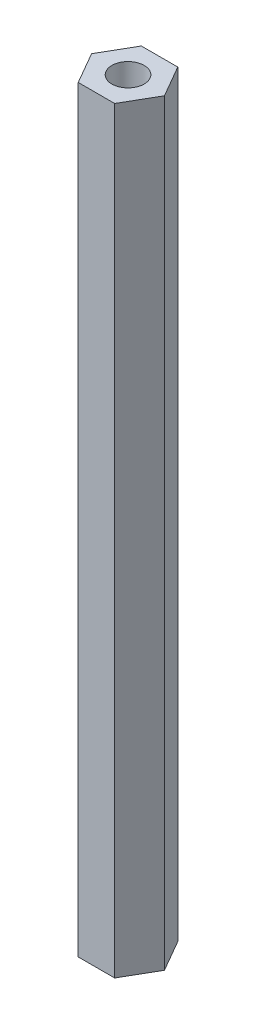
ISO-10303-21;
HEADER;
FILE_DESCRIPTION(('STEP AP214'),'2;1');
FILE_NAME('part.step','',(''),(''),'','','');
FILE_SCHEMA(('AUTOMOTIVE_DESIGN { 1 0 10303 214 1 1 1 1 }'));
ENDSEC;
DATA;
#1=APPLICATION_CONTEXT('core data for automotive mechanical design processes');
#2=APPLICATION_PROTOCOL_DEFINITION('international standard','automotive_design',2000,#1);
#3=PRODUCT_CONTEXT('',#1,'mechanical');
#4=PRODUCT('Part','Part','',(#3));
#5=PRODUCT_RELATED_PRODUCT_CATEGORY('part','',(#4));
#6=PRODUCT_DEFINITION_FORMATION('','',#4);
#7=PRODUCT_DEFINITION_CONTEXT('part definition',#1,'design');
#8=PRODUCT_DEFINITION('design','',#6,#7);
#9=PRODUCT_DEFINITION_SHAPE('','',#8);
#10=(LENGTH_UNIT() NAMED_UNIT(*) SI_UNIT(.MILLI.,.METRE.));
#11=(NAMED_UNIT(*) PLANE_ANGLE_UNIT() SI_UNIT($,.RADIAN.));
#12=(NAMED_UNIT(*) SI_UNIT($,.STERADIAN.) SOLID_ANGLE_UNIT());
#13=UNCERTAINTY_MEASURE_WITH_UNIT(LENGTH_MEASURE(1.E-05),#10,'distance_accuracy_value','');
#14=(GEOMETRIC_REPRESENTATION_CONTEXT(3) GLOBAL_UNCERTAINTY_ASSIGNED_CONTEXT((#13)) GLOBAL_UNIT_ASSIGNED_CONTEXT((#10,
#11,#12)) REPRESENTATION_CONTEXT('',''));
#15=CARTESIAN_POINT('',(0.,0.,0.));
#16=DIRECTION('',(0.,0.,1.));
#17=DIRECTION('',(1.,0.,0.));
#18=AXIS2_PLACEMENT_3D('',#15,#16,#17);
#19=CARTESIAN_POINT('',(0.,76.2,0.));
#20=DIRECTION('',(0.,1.,0.));
#21=DIRECTION('',(0.,0.,1.));
#22=AXIS2_PLACEMENT_3D('',#19,#20,#21);
#23=PLANE('',#22);
#24=DIRECTION('',(-0.500000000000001,0.,-0.866025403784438));
#25=VECTOR('',#24,1.);
#26=CARTESIAN_POINT('',(3.66617420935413,76.2,0.));
#27=LINE('',#26,#25);
#28=CARTESIAN_POINT('',(3.66617420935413,76.2,0.));
#29=VERTEX_POINT('',#28);
#30=CARTESIAN_POINT('',(1.83308710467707,76.2,-3.175));
#31=VERTEX_POINT('',#30);
#32=EDGE_CURVE('E129',#29,#31,#27,.T.);
#33=ORIENTED_EDGE('',*,*,#32,.T.);
#34=DIRECTION('',(-1.,0.,0.));
#35=VECTOR('',#34,1.);
#36=CARTESIAN_POINT('',(1.83308710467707,76.2,-3.175));
#37=LINE('',#36,#35);
#38=CARTESIAN_POINT('',(-1.83308710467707,76.2,-3.175));
#39=VERTEX_POINT('',#38);
#40=EDGE_CURVE('E87',#31,#39,#37,.T.);
#41=ORIENTED_EDGE('',*,*,#40,.T.);
#42=DIRECTION('',(-0.500000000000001,0.,0.866025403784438));
#43=VECTOR('',#42,1.);
#44=CARTESIAN_POINT('',(-1.83308710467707,76.2,-3.175));
#45=LINE('',#44,#43);
#46=CARTESIAN_POINT('',(-3.66617420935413,76.2,0.));
#47=VERTEX_POINT('',#46);
#48=EDGE_CURVE('E100',#39,#47,#45,.T.);
#49=ORIENTED_EDGE('',*,*,#48,.T.);
#50=DIRECTION('',(0.5,0.,0.866025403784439));
#51=VECTOR('',#50,1.);
#52=CARTESIAN_POINT('',(-3.66617420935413,76.2,0.));
#53=LINE('',#52,#51);
#54=CARTESIAN_POINT('',(-1.83308710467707,76.2,3.175));
#55=VERTEX_POINT('',#54);
#56=EDGE_CURVE('E94',#47,#55,#53,.T.);
#57=ORIENTED_EDGE('',*,*,#56,.T.);
#58=DIRECTION('',(1.,0.,0.));
#59=VECTOR('',#58,1.);
#60=CARTESIAN_POINT('',(-1.83308710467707,76.2,3.175));
#61=LINE('',#60,#59);
#62=CARTESIAN_POINT('',(1.83308710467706,76.2,3.175));
#63=VERTEX_POINT('',#62);
#64=EDGE_CURVE('E98',#55,#63,#61,.T.);
#65=ORIENTED_EDGE('',*,*,#64,.T.);
#66=DIRECTION('',(0.500000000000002,0.,-0.866025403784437));
#67=VECTOR('',#66,1.);
#68=CARTESIAN_POINT('',(1.83308710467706,76.2,3.175));
#69=LINE('',#68,#67);
#70=EDGE_CURVE('E50',#63,#29,#69,.T.);
#71=ORIENTED_EDGE('',*,*,#70,.T.);
#72=EDGE_LOOP('',(#33,#41,#49,#57,#65,#71));
#73=FACE_BOUND('',#72,.T.);
#74=CARTESIAN_POINT('',(0.,76.2,0.));
#75=DIRECTION('',(0.,1.,0.));
#76=DIRECTION('',(0.,0.,1.));
#77=AXIS2_PLACEMENT_3D('',#74,#75,#76);
#78=CIRCLE('',#77,1.6256);
#79=CARTESIAN_POINT('',(0.,76.2,-1.6256));
#80=VERTEX_POINT('',#79);
#81=EDGE_CURVE('E122',#80,#80,#78,.T.);
#82=ORIENTED_EDGE('',*,*,#81,.F.);
#83=EDGE_LOOP('',(#82));
#84=FACE_BOUND('',#83,.T.);
#85=ADVANCED_FACE('F33',(#73,#84),#23,.T.);
#86=CARTESIAN_POINT('',(0.,0.,0.));
#87=DIRECTION('',(0.,1.,0.));
#88=DIRECTION('',(0.,0.,1.));
#89=AXIS2_PLACEMENT_3D('',#86,#87,#88);
#90=PLANE('',#89);
#91=DIRECTION('',(-0.500000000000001,0.,-0.866025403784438));
#92=VECTOR('',#91,1.);
#93=CARTESIAN_POINT('',(3.66617420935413,0.,0.));
#94=LINE('',#93,#92);
#95=CARTESIAN_POINT('',(3.66617420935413,0.,0.));
#96=VERTEX_POINT('',#95);
#97=CARTESIAN_POINT('',(1.83308710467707,0.,-3.175));
#98=VERTEX_POINT('',#97);
#99=EDGE_CURVE('E118',#96,#98,#94,.T.);
#100=ORIENTED_EDGE('',*,*,#99,.F.);
#101=DIRECTION('',(0.500000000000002,0.,-0.866025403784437));
#102=VECTOR('',#101,1.);
#103=CARTESIAN_POINT('',(1.83308710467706,0.,3.175));
#104=LINE('',#103,#102);
#105=CARTESIAN_POINT('',(1.83308710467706,0.,3.175));
#106=VERTEX_POINT('',#105);
#107=EDGE_CURVE('E79',#106,#96,#104,.T.);
#108=ORIENTED_EDGE('',*,*,#107,.F.);
#109=DIRECTION('',(1.,0.,0.));
#110=VECTOR('',#109,1.);
#111=CARTESIAN_POINT('',(-1.83308710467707,0.,3.175));
#112=LINE('',#111,#110);
#113=CARTESIAN_POINT('',(-1.83308710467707,0.,3.175));
#114=VERTEX_POINT('',#113);
#115=EDGE_CURVE('E73',#114,#106,#112,.T.);
#116=ORIENTED_EDGE('',*,*,#115,.F.);
#117=DIRECTION('',(0.5,0.,0.866025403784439));
#118=VECTOR('',#117,1.);
#119=CARTESIAN_POINT('',(-3.66617420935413,0.,0.));
#120=LINE('',#119,#118);
#121=CARTESIAN_POINT('',(-3.66617420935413,0.,0.));
#122=VERTEX_POINT('',#121);
#123=EDGE_CURVE('E108',#122,#114,#120,.T.);
#124=ORIENTED_EDGE('',*,*,#123,.F.);
#125=DIRECTION('',(-0.500000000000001,0.,0.866025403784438));
#126=VECTOR('',#125,1.);
#127=CARTESIAN_POINT('',(-1.83308710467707,0.,-3.175));
#128=LINE('',#127,#126);
#129=CARTESIAN_POINT('',(-1.83308710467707,0.,-3.175));
#130=VERTEX_POINT('',#129);
#131=EDGE_CURVE('E124',#130,#122,#128,.T.);
#132=ORIENTED_EDGE('',*,*,#131,.F.);
#133=DIRECTION('',(-1.,0.,0.));
#134=VECTOR('',#133,1.);
#135=CARTESIAN_POINT('',(1.83308710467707,0.,-3.175));
#136=LINE('',#135,#134);
#137=EDGE_CURVE('E121',#98,#130,#136,.T.);
#138=ORIENTED_EDGE('',*,*,#137,.F.);
#139=EDGE_LOOP('',(#100,#108,#116,#124,#132,#138));
#140=FACE_BOUND('',#139,.T.);
#141=CARTESIAN_POINT('',(0.,0.,0.));
#142=DIRECTION('',(0.,1.,0.));
#143=DIRECTION('',(0.,0.,1.));
#144=AXIS2_PLACEMENT_3D('',#141,#142,#143);
#145=CIRCLE('',#144,1.6256);
#146=CARTESIAN_POINT('',(0.,0.,-1.6256));
#147=VERTEX_POINT('',#146);
#148=EDGE_CURVE('E222',#147,#147,#145,.T.);
#149=ORIENTED_EDGE('',*,*,#148,.T.);
#150=EDGE_LOOP('',(#149));
#151=FACE_BOUND('',#150,.T.);
#152=ADVANCED_FACE('F138',(#140,#151),#90,.F.);
#153=CARTESIAN_POINT('',(3.66617420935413,76.2,0.));
#154=DIRECTION('',(-0.866025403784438,0.,0.500000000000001));
#155=DIRECTION('',(0.500000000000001,0.,0.866025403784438));
#156=AXIS2_PLACEMENT_3D('',#153,#154,#155);
#157=PLANE('',#156);
#158=ORIENTED_EDGE('',*,*,#99,.T.);
#159=DIRECTION('',(0.,-1.,0.));
#160=VECTOR('',#159,1.);
#161=CARTESIAN_POINT('',(1.83308710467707,76.2,-3.175));
#162=LINE('',#161,#160);
#163=EDGE_CURVE('E11',#31,#98,#162,.T.);
#164=ORIENTED_EDGE('',*,*,#163,.F.);
#165=ORIENTED_EDGE('',*,*,#32,.F.);
#166=DIRECTION('',(0.,-1.,0.));
#167=VECTOR('',#166,1.);
#168=CARTESIAN_POINT('',(3.66617420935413,76.2,0.));
#169=LINE('',#168,#167);
#170=EDGE_CURVE('E114',#29,#96,#169,.T.);
#171=ORIENTED_EDGE('',*,*,#170,.T.);
#172=EDGE_LOOP('',(#158,#164,#165,#171));
#173=FACE_BOUND('',#172,.T.);
#174=ADVANCED_FACE('F35',(#173),#157,.F.);
#175=CARTESIAN_POINT('',(1.83308710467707,76.2,-3.175));
#176=DIRECTION('',(0.,0.,1.));
#177=DIRECTION('',(1.,0.,0.));
#178=AXIS2_PLACEMENT_3D('',#175,#176,#177);
#179=PLANE('',#178);
#180=ORIENTED_EDGE('',*,*,#137,.T.);
#181=DIRECTION('',(0.,-1.,0.));
#182=VECTOR('',#181,1.);
#183=CARTESIAN_POINT('',(-1.83308710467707,76.2,-3.175));
#184=LINE('',#183,#182);
#185=EDGE_CURVE('E42',#39,#130,#184,.T.);
#186=ORIENTED_EDGE('',*,*,#185,.F.);
#187=ORIENTED_EDGE('',*,*,#40,.F.);
#188=ORIENTED_EDGE('',*,*,#163,.T.);
#189=EDGE_LOOP('',(#180,#186,#187,#188));
#190=FACE_BOUND('',#189,.T.);
#191=ADVANCED_FACE('F163',(#190),#179,.F.);
#192=CARTESIAN_POINT('',(-1.83308710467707,76.2,-3.175));
#193=DIRECTION('',(0.866025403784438,0.,0.500000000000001));
#194=DIRECTION('',(0.500000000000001,0.,-0.866025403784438));
#195=AXIS2_PLACEMENT_3D('',#192,#193,#194);
#196=PLANE('',#195);
#197=ORIENTED_EDGE('',*,*,#131,.T.);
#198=DIRECTION('',(0.,-1.,0.));
#199=VECTOR('',#198,1.);
#200=CARTESIAN_POINT('',(-3.66617420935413,76.2,0.));
#201=LINE('',#200,#199);
#202=EDGE_CURVE('E109',#47,#122,#201,.T.);
#203=ORIENTED_EDGE('',*,*,#202,.F.);
#204=ORIENTED_EDGE('',*,*,#48,.F.);
#205=ORIENTED_EDGE('',*,*,#185,.T.);
#206=EDGE_LOOP('',(#197,#203,#204,#205));
#207=FACE_BOUND('',#206,.T.);
#208=ADVANCED_FACE('F135',(#207),#196,.F.);
#209=CARTESIAN_POINT('',(-3.66617420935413,76.2,0.));
#210=DIRECTION('',(0.866025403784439,0.,-0.5));
#211=DIRECTION('',(-0.5,0.,-0.866025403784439));
#212=AXIS2_PLACEMENT_3D('',#209,#210,#211);
#213=PLANE('',#212);
#214=ORIENTED_EDGE('',*,*,#123,.T.);
#215=DIRECTION('',(0.,-1.,0.));
#216=VECTOR('',#215,1.);
#217=CARTESIAN_POINT('',(-1.83308710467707,76.2,3.175));
#218=LINE('',#217,#216);
#219=EDGE_CURVE('E105',#55,#114,#218,.T.);
#220=ORIENTED_EDGE('',*,*,#219,.F.);
#221=ORIENTED_EDGE('',*,*,#56,.F.);
#222=ORIENTED_EDGE('',*,*,#202,.T.);
#223=EDGE_LOOP('',(#214,#220,#221,#222));
#224=FACE_BOUND('',#223,.T.);
#225=ADVANCED_FACE('F106',(#224),#213,.F.);
#226=CARTESIAN_POINT('',(-1.83308710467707,76.2,3.175));
#227=DIRECTION('',(0.,0.,-1.));
#228=DIRECTION('',(-1.,0.,0.));
#229=AXIS2_PLACEMENT_3D('',#226,#227,#228);
#230=PLANE('',#229);
#231=ORIENTED_EDGE('',*,*,#115,.T.);
#232=DIRECTION('',(0.,-1.,0.));
#233=VECTOR('',#232,1.);
#234=CARTESIAN_POINT('',(1.83308710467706,76.2,3.175));
#235=LINE('',#234,#233);
#236=EDGE_CURVE('E110',#63,#106,#235,.T.);
#237=ORIENTED_EDGE('',*,*,#236,.F.);
#238=ORIENTED_EDGE('',*,*,#64,.F.);
#239=ORIENTED_EDGE('',*,*,#219,.T.);
#240=EDGE_LOOP('',(#231,#237,#238,#239));
#241=FACE_BOUND('',#240,.T.);
#242=ADVANCED_FACE('F112',(#241),#230,.F.);
#243=CARTESIAN_POINT('',(1.83308710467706,76.2,3.175));
#244=DIRECTION('',(-0.866025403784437,0.,-0.500000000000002));
#245=DIRECTION('',(-0.500000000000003,0.,0.866025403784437));
#246=AXIS2_PLACEMENT_3D('',#243,#244,#245);
#247=PLANE('',#246);
#248=ORIENTED_EDGE('',*,*,#107,.T.);
#249=ORIENTED_EDGE('',*,*,#170,.F.);
#250=ORIENTED_EDGE('',*,*,#70,.F.);
#251=ORIENTED_EDGE('',*,*,#236,.T.);
#252=EDGE_LOOP('',(#248,#249,#250,#251));
#253=FACE_BOUND('',#252,.T.);
#254=ADVANCED_FACE('F143',(#253),#247,.F.);
#255=CARTESIAN_POINT('',(0.,76.2,0.));
#256=DIRECTION('',(0.,-1.,0.));
#257=DIRECTION('',(0.,0.,-1.));
#258=AXIS2_PLACEMENT_3D('',#255,#256,#257);
#259=CYLINDRICAL_SURFACE('',#258,1.6256);
#260=CARTESIAN_POINT('',(0.,76.2,-1.6256));
#261=CARTESIAN_POINT('',(0.,75.40625,-1.6256));
#262=CARTESIAN_POINT('',(0.,74.6125,-1.6256));
#263=CARTESIAN_POINT('',(0.,73.025,-1.6256));
#264=CARTESIAN_POINT('',(0.,72.23125,-1.6256));
#265=CARTESIAN_POINT('',(0.,70.64375,-1.6256));
#266=CARTESIAN_POINT('',(0.,69.85,-1.6256));
#267=CARTESIAN_POINT('',(0.,68.2625,-1.6256));
#268=CARTESIAN_POINT('',(0.,67.46875,-1.6256));
#269=CARTESIAN_POINT('',(0.,65.88125,-1.6256));
#270=CARTESIAN_POINT('',(0.,65.0875,-1.6256));
#271=CARTESIAN_POINT('',(0.,63.5,-1.6256));
#272=CARTESIAN_POINT('',(0.,62.70625,-1.6256));
#273=CARTESIAN_POINT('',(0.,61.11875,-1.6256));
#274=CARTESIAN_POINT('',(0.,60.325,-1.6256));
#275=CARTESIAN_POINT('',(0.,58.7375,-1.6256));
#276=CARTESIAN_POINT('',(0.,57.94375,-1.6256));
#277=CARTESIAN_POINT('',(0.,56.35625,-1.6256));
#278=CARTESIAN_POINT('',(0.,55.5625,-1.6256));
#279=CARTESIAN_POINT('',(0.,53.975,-1.6256));
#280=CARTESIAN_POINT('',(0.,53.18125,-1.6256));
#281=CARTESIAN_POINT('',(0.,51.59375,-1.6256));
#282=CARTESIAN_POINT('',(0.,50.8,-1.6256));
#283=CARTESIAN_POINT('',(0.,49.2125,-1.6256));
#284=CARTESIAN_POINT('',(0.,48.41875,-1.6256));
#285=CARTESIAN_POINT('',(0.,46.83125,-1.6256));
#286=CARTESIAN_POINT('',(0.,46.0375,-1.6256));
#287=CARTESIAN_POINT('',(0.,44.45,-1.6256));
#288=CARTESIAN_POINT('',(0.,43.65625,-1.6256));
#289=CARTESIAN_POINT('',(0.,42.06875,-1.6256));
#290=CARTESIAN_POINT('',(0.,41.275,-1.6256));
#291=CARTESIAN_POINT('',(0.,39.6875,-1.6256));
#292=CARTESIAN_POINT('',(0.,38.89375,-1.6256));
#293=CARTESIAN_POINT('',(0.,37.30625,-1.6256));
#294=CARTESIAN_POINT('',(0.,36.5125,-1.6256));
#295=CARTESIAN_POINT('',(0.,34.925,-1.6256));
#296=CARTESIAN_POINT('',(0.,34.13125,-1.6256));
#297=CARTESIAN_POINT('',(0.,32.54375,-1.6256));
#298=CARTESIAN_POINT('',(0.,31.75,-1.6256));
#299=CARTESIAN_POINT('',(0.,30.1625,-1.6256));
#300=CARTESIAN_POINT('',(0.,29.36875,-1.6256));
#301=CARTESIAN_POINT('',(0.,27.78125,-1.6256));
#302=CARTESIAN_POINT('',(0.,26.9875,-1.6256));
#303=CARTESIAN_POINT('',(0.,25.4,-1.6256));
#304=CARTESIAN_POINT('',(0.,24.60625,-1.6256));
#305=CARTESIAN_POINT('',(0.,23.01875,-1.6256));
#306=CARTESIAN_POINT('',(0.,22.225,-1.6256));
#307=CARTESIAN_POINT('',(0.,20.6375,-1.6256));
#308=CARTESIAN_POINT('',(0.,19.84375,-1.6256));
#309=CARTESIAN_POINT('',(0.,18.25625,-1.6256));
#310=CARTESIAN_POINT('',(0.,17.4625,-1.6256));
#311=CARTESIAN_POINT('',(0.,15.875,-1.6256));
#312=CARTESIAN_POINT('',(0.,15.08125,-1.6256));
#313=CARTESIAN_POINT('',(0.,13.49375,-1.6256));
#314=CARTESIAN_POINT('',(0.,12.7,-1.6256));
#315=CARTESIAN_POINT('',(0.,11.1125,-1.6256));
#316=CARTESIAN_POINT('',(0.,10.31875,-1.6256));
#317=CARTESIAN_POINT('',(0.,8.73125,-1.6256));
#318=CARTESIAN_POINT('',(0.,7.93750000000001,-1.6256));
#319=CARTESIAN_POINT('',(0.,6.35,-1.6256));
#320=CARTESIAN_POINT('',(0.,5.55625,-1.6256));
#321=CARTESIAN_POINT('',(0.,3.96875,-1.6256));
#322=CARTESIAN_POINT('',(0.,3.175,-1.6256));
#323=CARTESIAN_POINT('',(0.,1.5875,-1.6256));
#324=CARTESIAN_POINT('',(0.,0.793750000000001,-1.6256));
#325=CARTESIAN_POINT('',(0.,0.,-1.6256));
#326=B_SPLINE_CURVE_WITH_KNOTS('',3,(#260,#261,#262,#263,#264,#265,#266,#267,#268,#269,#270,
#271,#272,#273,#274,#275,#276,#277,#278,#279,#280,#281,#282,#283,#284,#285,#286,#287,#288,#289,
#290,#291,#292,#293,#294,#295,#296,#297,#298,#299,#300,#301,#302,#303,#304,#305,#306,#307,#308,
#309,#310,#311,#312,#313,#314,#315,#316,#317,#318,#319,#320,#321,#322,#323,#324,#325),
.UNSPECIFIED.,.F.,.F.,(4,2,2,2,2,2,2,2,2,2,2,2,2,2,2,2,2,2,2,2,2,2,2,2,2,2,2,2,2,2,2,2,4),(0.,
2.38124999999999,4.76249999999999,7.14374999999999,9.52499999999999,11.90625,14.2875,16.66875,
19.05,21.43125,23.8125,26.19375,28.575,30.95625,33.3375,35.71875,38.1,40.48125,42.8625,45.24375,
47.625,50.00625,52.3875,54.76875,57.15,59.53125,61.9125,64.29375,66.675,69.05625,71.4375,
73.81875,76.2),.UNSPECIFIED.);
#327=EDGE_CURVE('BSEAM145',#80,#147,#326,.T.);
#328=ORIENTED_EDGE('',*,*,#81,.T.);
#329=ORIENTED_EDGE('',*,*,#148,.F.);
#330=ORIENTED_EDGE('',*,*,#327,.T.);
#331=ORIENTED_EDGE('',*,*,#327,.F.);
#332=EDGE_LOOP('',(#328,#330,#329,#331));
#333=FACE_BOUND('',#332,.T.);
#334=ADVANCED_FACE('F145',(#333),#259,.F.);
#335=CLOSED_SHELL('',(#85,#152,#174,#191,#208,#225,#242,#254,#334));
#336=MANIFOLD_SOLID_BREP('B2',#335);
#337=ADVANCED_BREP_SHAPE_REPRESENTATION('',(#18,#336),#14);
#338=SHAPE_DEFINITION_REPRESENTATION(#9,#337);
ENDSEC;
END-ISO-10303-21;
